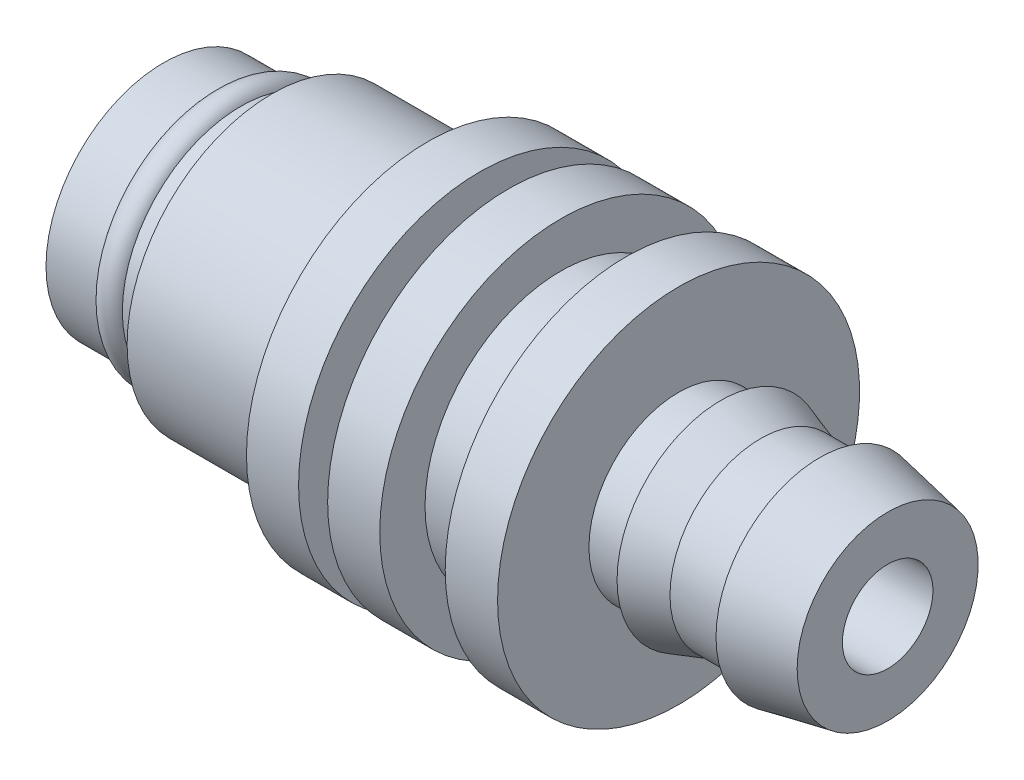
ISO-10303-21;
HEADER;
FILE_DESCRIPTION(('STEP AP214'),'2;1');
FILE_NAME('part.step','',(''),(''),'','','');
FILE_SCHEMA(('AUTOMOTIVE_DESIGN { 1 0 10303 214 1 1 1 1 }'));
ENDSEC;
DATA;
#1=APPLICATION_CONTEXT('core data for automotive mechanical design processes');
#2=APPLICATION_PROTOCOL_DEFINITION('international standard','automotive_design',2000,#1);
#3=PRODUCT_CONTEXT('',#1,'mechanical');
#4=PRODUCT('Part','Part','',(#3));
#5=PRODUCT_RELATED_PRODUCT_CATEGORY('part','',(#4));
#6=PRODUCT_DEFINITION_FORMATION('','',#4);
#7=PRODUCT_DEFINITION_CONTEXT('part definition',#1,'design');
#8=PRODUCT_DEFINITION('design','',#6,#7);
#9=PRODUCT_DEFINITION_SHAPE('','',#8);
#10=(LENGTH_UNIT() NAMED_UNIT(*) SI_UNIT(.MILLI.,.METRE.));
#11=(NAMED_UNIT(*) PLANE_ANGLE_UNIT() SI_UNIT($,.RADIAN.));
#12=(NAMED_UNIT(*) SI_UNIT($,.STERADIAN.) SOLID_ANGLE_UNIT());
#13=UNCERTAINTY_MEASURE_WITH_UNIT(LENGTH_MEASURE(1.E-05),#10,'distance_accuracy_value','');
#14=(GEOMETRIC_REPRESENTATION_CONTEXT(3) GLOBAL_UNCERTAINTY_ASSIGNED_CONTEXT((#13)) GLOBAL_UNIT_ASSIGNED_CONTEXT((#10,
#11,#12)) REPRESENTATION_CONTEXT('',''));
#15=CARTESIAN_POINT('',(0.,0.,0.));
#16=DIRECTION('',(0.,0.,1.));
#17=DIRECTION('',(1.,0.,0.));
#18=AXIS2_PLACEMENT_3D('',#15,#16,#17);
#19=CARTESIAN_POINT('',(11.8147389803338,0.,0.));
#20=DIRECTION('',(-1.,0.,0.));
#21=DIRECTION('',(0.,0.,1.));
#22=AXIS2_PLACEMENT_3D('',#19,#20,#21);
#23=CYLINDRICAL_SURFACE('',#22,2.5);
#24=CARTESIAN_POINT('',(51.8147389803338,0.,0.));
#25=DIRECTION('',(-1.,0.,0.));
#26=DIRECTION('',(0.,0.,1.));
#27=AXIS2_PLACEMENT_3D('',#24,#25,#26);
#28=CIRCLE('',#27,2.5);
#29=CARTESIAN_POINT('',(51.8147389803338,0.,2.5));
#30=VERTEX_POINT('',#29);
#31=EDGE_CURVE('E92',#30,#30,#28,.T.);
#32=ORIENTED_EDGE('',*,*,#31,.F.);
#33=EDGE_LOOP('',(#32));
#34=FACE_BOUND('',#33,.T.);
#35=CARTESIAN_POINT('',(11.8147389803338,0.,0.));
#36=DIRECTION('',(-1.,0.,0.));
#37=DIRECTION('',(0.,0.,1.));
#38=AXIS2_PLACEMENT_3D('',#35,#36,#37);
#39=CIRCLE('',#38,2.5);
#40=CARTESIAN_POINT('',(11.8147389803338,0.,2.5));
#41=VERTEX_POINT('',#40);
#42=EDGE_CURVE('E8',#41,#41,#39,.T.);
#43=ORIENTED_EDGE('',*,*,#42,.T.);
#44=EDGE_LOOP('',(#43));
#45=FACE_BOUND('',#44,.T.);
#46=ADVANCED_FACE('F13',(#34,#45),#23,.F.);
#47=CARTESIAN_POINT('',(11.8147389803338,2.5,0.));
#48=DIRECTION('',(1.,0.,0.));
#49=DIRECTION('',(0.,0.,-1.));
#50=AXIS2_PLACEMENT_3D('',#47,#48,#49);
#51=PLANE('',#50);
#52=ORIENTED_EDGE('',*,*,#42,.F.);
#53=EDGE_LOOP('',(#52));
#54=FACE_BOUND('',#53,.T.);
#55=CARTESIAN_POINT('',(11.8147389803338,0.,0.));
#56=DIRECTION('',(-1.,0.,0.));
#57=DIRECTION('',(0.,0.,1.));
#58=AXIS2_PLACEMENT_3D('',#55,#56,#57);
#59=CIRCLE('',#58,6.5);
#60=CARTESIAN_POINT('',(11.8147389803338,0.,6.5));
#61=VERTEX_POINT('',#60);
#62=EDGE_CURVE('E19',#61,#61,#59,.T.);
#63=ORIENTED_EDGE('',*,*,#62,.T.);
#64=EDGE_LOOP('',(#63));
#65=FACE_BOUND('',#64,.T.);
#66=ADVANCED_FACE('F99',(#54,#65),#51,.F.);
#67=CARTESIAN_POINT('',(11.8147389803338,0.,0.));
#68=DIRECTION('',(-1.,0.,0.));
#69=DIRECTION('',(0.,0.,1.));
#70=AXIS2_PLACEMENT_3D('',#67,#68,#69);
#71=CYLINDRICAL_SURFACE('',#70,6.5);
#72=ORIENTED_EDGE('',*,*,#62,.F.);
#73=EDGE_LOOP('',(#72));
#74=FACE_BOUND('',#73,.T.);
#75=CARTESIAN_POINT('',(14.650729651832,0.,0.));
#76=DIRECTION('',(-1.,0.,0.));
#77=DIRECTION('',(0.,0.,1.));
#78=AXIS2_PLACEMENT_3D('',#75,#76,#77);
#79=CIRCLE('',#78,6.5);
#80=CARTESIAN_POINT('',(14.650729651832,0.,6.5));
#81=VERTEX_POINT('',#80);
#82=EDGE_CURVE('E23',#81,#81,#79,.T.);
#83=ORIENTED_EDGE('',*,*,#82,.T.);
#84=EDGE_LOOP('',(#83));
#85=FACE_BOUND('',#84,.T.);
#86=ADVANCED_FACE('F105',(#74,#85),#71,.T.);
#87=CARTESIAN_POINT('',(15.3792672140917,0.,0.));
#88=DIRECTION('',(-1.,0.,0.));
#89=DIRECTION('',(0.,0.,1.));
#90=AXIS2_PLACEMENT_3D('',#87,#88,#89);
#91=TOROIDAL_SURFACE('',#90,6.17291713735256,0.79859262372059);
#92=ORIENTED_EDGE('',*,*,#82,.F.);
#93=EDGE_LOOP('',(#92));
#94=FACE_BOUND('',#93,.T.);
#95=CARTESIAN_POINT('',(16.0830470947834,0.,0.));
#96=DIRECTION('',(-1.,0.,0.));
#97=DIRECTION('',(0.,0.,1.));
#98=AXIS2_PLACEMENT_3D('',#95,#96,#97);
#99=CIRCLE('',#98,6.550334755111);
#100=CARTESIAN_POINT('',(16.0830470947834,0.,6.550334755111));
#101=VERTEX_POINT('',#100);
#102=EDGE_CURVE('E27',#101,#101,#99,.T.);
#103=ORIENTED_EDGE('',*,*,#102,.T.);
#104=EDGE_LOOP('',(#103));
#105=FACE_BOUND('',#104,.T.);
#106=ADVANCED_FACE('F111',(#94,#105),#91,.T.);
#107=CARTESIAN_POINT('',(11.8147389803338,0.,0.));
#108=DIRECTION('',(-1.,0.,0.));
#109=DIRECTION('',(0.,0.,1.));
#110=AXIS2_PLACEMENT_3D('',#107,#108,#109);
#111=CYLINDRICAL_SURFACE('',#110,6.550334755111);
#112=ORIENTED_EDGE('',*,*,#102,.F.);
#113=EDGE_LOOP('',(#112));
#114=FACE_BOUND('',#113,.T.);
#115=CARTESIAN_POINT('',(17.7956472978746,0.,0.));
#116=DIRECTION('',(-1.,0.,0.));
#117=DIRECTION('',(0.,0.,1.));
#118=AXIS2_PLACEMENT_3D('',#115,#116,#117);
#119=CIRCLE('',#118,6.550334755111);
#120=CARTESIAN_POINT('',(17.7956472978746,0.,6.550334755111));
#121=VERTEX_POINT('',#120);
#122=EDGE_CURVE('E32',#121,#121,#119,.T.);
#123=ORIENTED_EDGE('',*,*,#122,.T.);
#124=EDGE_LOOP('',(#123));
#125=FACE_BOUND('',#124,.T.);
#126=ADVANCED_FACE('F117',(#114,#125),#111,.T.);
#127=CARTESIAN_POINT('',(17.7956472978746,6.550334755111,0.));
#128=DIRECTION('',(1.,0.,0.));
#129=DIRECTION('',(0.,0.,-1.));
#130=AXIS2_PLACEMENT_3D('',#127,#128,#129);
#131=PLANE('',#130);
#132=ORIENTED_EDGE('',*,*,#122,.F.);
#133=EDGE_LOOP('',(#132));
#134=FACE_BOUND('',#133,.T.);
#135=CARTESIAN_POINT('',(17.7956472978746,0.,0.));
#136=DIRECTION('',(-1.,0.,0.));
#137=DIRECTION('',(0.,0.,1.));
#138=AXIS2_PLACEMENT_3D('',#135,#136,#137);
#139=CIRCLE('',#138,8.);
#140=CARTESIAN_POINT('',(17.7956472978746,0.,8.));
#141=VERTEX_POINT('',#140);
#142=EDGE_CURVE('E35',#141,#141,#139,.T.);
#143=ORIENTED_EDGE('',*,*,#142,.T.);
#144=EDGE_LOOP('',(#143));
#145=FACE_BOUND('',#144,.T.);
#146=ADVANCED_FACE('F121',(#134,#145),#131,.F.);
#147=CARTESIAN_POINT('',(11.8147389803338,0.,0.));
#148=DIRECTION('',(-1.,0.,0.));
#149=DIRECTION('',(0.,0.,1.));
#150=AXIS2_PLACEMENT_3D('',#147,#148,#149);
#151=CYLINDRICAL_SURFACE('',#150,8.);
#152=ORIENTED_EDGE('',*,*,#142,.F.);
#153=EDGE_LOOP('',(#152));
#154=FACE_BOUND('',#153,.T.);
#155=CARTESIAN_POINT('',(26.3895519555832,0.,0.));
#156=DIRECTION('',(-1.,0.,0.));
#157=DIRECTION('',(0.,0.,1.));
#158=AXIS2_PLACEMENT_3D('',#155,#156,#157);
#159=CIRCLE('',#158,8.);
#160=CARTESIAN_POINT('',(26.3895519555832,0.,8.));
#161=VERTEX_POINT('',#160);
#162=EDGE_CURVE('E38',#161,#161,#159,.T.);
#163=ORIENTED_EDGE('',*,*,#162,.T.);
#164=EDGE_LOOP('',(#163));
#165=FACE_BOUND('',#164,.T.);
#166=ADVANCED_FACE('F125',(#154,#165),#151,.T.);
#167=CARTESIAN_POINT('',(26.3895519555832,8.,0.));
#168=DIRECTION('',(1.,0.,0.));
#169=DIRECTION('',(0.,0.,-1.));
#170=AXIS2_PLACEMENT_3D('',#167,#168,#169);
#171=PLANE('',#170);
#172=ORIENTED_EDGE('',*,*,#162,.F.);
#173=EDGE_LOOP('',(#172));
#174=FACE_BOUND('',#173,.T.);
#175=CARTESIAN_POINT('',(26.3895519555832,0.,0.));
#176=DIRECTION('',(-1.,0.,0.));
#177=DIRECTION('',(0.,0.,1.));
#178=AXIS2_PLACEMENT_3D('',#175,#176,#177);
#179=CIRCLE('',#178,10.);
#180=CARTESIAN_POINT('',(26.3895519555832,0.,10.));
#181=VERTEX_POINT('',#180);
#182=EDGE_CURVE('E41',#181,#181,#179,.T.);
#183=ORIENTED_EDGE('',*,*,#182,.T.);
#184=EDGE_LOOP('',(#183));
#185=FACE_BOUND('',#184,.T.);
#186=ADVANCED_FACE('F129',(#174,#185),#171,.F.);
#187=CARTESIAN_POINT('',(11.8147389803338,0.,0.));
#188=DIRECTION('',(-1.,0.,0.));
#189=DIRECTION('',(0.,0.,1.));
#190=AXIS2_PLACEMENT_3D('',#187,#188,#189);
#191=CYLINDRICAL_SURFACE('',#190,10.);
#192=ORIENTED_EDGE('',*,*,#182,.F.);
#193=EDGE_LOOP('',(#192));
#194=FACE_BOUND('',#193,.T.);
#195=CARTESIAN_POINT('',(29.2685404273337,0.,0.));
#196=DIRECTION('',(-1.,0.,0.));
#197=DIRECTION('',(0.,0.,1.));
#198=AXIS2_PLACEMENT_3D('',#195,#196,#197);
#199=CIRCLE('',#198,10.);
#200=CARTESIAN_POINT('',(29.2685404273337,0.,10.));
#201=VERTEX_POINT('',#200);
#202=EDGE_CURVE('E44',#201,#201,#199,.T.);
#203=ORIENTED_EDGE('',*,*,#202,.T.);
#204=EDGE_LOOP('',(#203));
#205=FACE_BOUND('',#204,.T.);
#206=ADVANCED_FACE('F133',(#194,#205),#191,.T.);
#207=CARTESIAN_POINT('',(29.2685404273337,10.,0.));
#208=DIRECTION('',(-1.,0.,0.));
#209=DIRECTION('',(0.,0.,1.));
#210=AXIS2_PLACEMENT_3D('',#207,#208,#209);
#211=PLANE('',#210);
#212=ORIENTED_EDGE('',*,*,#202,.F.);
#213=EDGE_LOOP('',(#212));
#214=FACE_BOUND('',#213,.T.);
#215=CARTESIAN_POINT('',(29.2685404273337,0.,0.));
#216=DIRECTION('',(-1.,0.,0.));
#217=DIRECTION('',(0.,0.,1.));
#218=AXIS2_PLACEMENT_3D('',#215,#216,#217);
#219=CIRCLE('',#218,7.5);
#220=CARTESIAN_POINT('',(29.2685404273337,0.,7.5));
#221=VERTEX_POINT('',#220);
#222=EDGE_CURVE('E47',#221,#221,#219,.T.);
#223=ORIENTED_EDGE('',*,*,#222,.T.);
#224=EDGE_LOOP('',(#223));
#225=FACE_BOUND('',#224,.T.);
#226=ADVANCED_FACE('F137',(#214,#225),#211,.F.);
#227=CARTESIAN_POINT('',(11.8147389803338,0.,0.));
#228=DIRECTION('',(-1.,0.,0.));
#229=DIRECTION('',(0.,0.,1.));
#230=AXIS2_PLACEMENT_3D('',#227,#228,#229);
#231=CYLINDRICAL_SURFACE('',#230,7.5);
#232=ORIENTED_EDGE('',*,*,#222,.F.);
#233=EDGE_LOOP('',(#232));
#234=FACE_BOUND('',#233,.T.);
#235=CARTESIAN_POINT('',(30.8744314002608,0.,0.));
#236=DIRECTION('',(-1.,0.,0.));
#237=DIRECTION('',(0.,0.,1.));
#238=AXIS2_PLACEMENT_3D('',#235,#236,#237);
#239=CIRCLE('',#238,7.5);
#240=CARTESIAN_POINT('',(30.8744314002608,0.,7.5));
#241=VERTEX_POINT('',#240);
#242=EDGE_CURVE('E50',#241,#241,#239,.T.);
#243=ORIENTED_EDGE('',*,*,#242,.T.);
#244=EDGE_LOOP('',(#243));
#245=FACE_BOUND('',#244,.T.);
#246=ADVANCED_FACE('F141',(#234,#245),#231,.T.);
#247=CARTESIAN_POINT('',(30.8744314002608,10.,0.));
#248=DIRECTION('',(1.,0.,0.));
#249=DIRECTION('',(0.,0.,-1.));
#250=AXIS2_PLACEMENT_3D('',#247,#248,#249);
#251=PLANE('',#250);
#252=ORIENTED_EDGE('',*,*,#242,.F.);
#253=EDGE_LOOP('',(#252));
#254=FACE_BOUND('',#253,.T.);
#255=CARTESIAN_POINT('',(30.8744314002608,0.,0.));
#256=DIRECTION('',(-1.,0.,0.));
#257=DIRECTION('',(0.,0.,1.));
#258=AXIS2_PLACEMENT_3D('',#255,#256,#257);
#259=CIRCLE('',#258,10.);
#260=CARTESIAN_POINT('',(30.8744314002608,0.,10.));
#261=VERTEX_POINT('',#260);
#262=EDGE_CURVE('E53',#261,#261,#259,.T.);
#263=ORIENTED_EDGE('',*,*,#262,.T.);
#264=EDGE_LOOP('',(#263));
#265=FACE_BOUND('',#264,.T.);
#266=ADVANCED_FACE('F145',(#254,#265),#251,.F.);
#267=CARTESIAN_POINT('',(11.8147389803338,0.,0.));
#268=DIRECTION('',(-1.,0.,0.));
#269=DIRECTION('',(0.,0.,1.));
#270=AXIS2_PLACEMENT_3D('',#267,#268,#269);
#271=CYLINDRICAL_SURFACE('',#270,10.);
#272=ORIENTED_EDGE('',*,*,#262,.F.);
#273=EDGE_LOOP('',(#272));
#274=FACE_BOUND('',#273,.T.);
#275=CARTESIAN_POINT('',(33.7534198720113,0.,0.));
#276=DIRECTION('',(-1.,0.,0.));
#277=DIRECTION('',(0.,0.,1.));
#278=AXIS2_PLACEMENT_3D('',#275,#276,#277);
#279=CIRCLE('',#278,10.);
#280=CARTESIAN_POINT('',(33.7534198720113,0.,10.));
#281=VERTEX_POINT('',#280);
#282=EDGE_CURVE('E56',#281,#281,#279,.T.);
#283=ORIENTED_EDGE('',*,*,#282,.T.);
#284=EDGE_LOOP('',(#283));
#285=FACE_BOUND('',#284,.T.);
#286=ADVANCED_FACE('F149',(#274,#285),#271,.T.);
#287=CARTESIAN_POINT('',(33.7534198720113,8.,0.));
#288=DIRECTION('',(-1.,0.,0.));
#289=DIRECTION('',(0.,0.,1.));
#290=AXIS2_PLACEMENT_3D('',#287,#288,#289);
#291=PLANE('',#290);
#292=ORIENTED_EDGE('',*,*,#282,.F.);
#293=EDGE_LOOP('',(#292));
#294=FACE_BOUND('',#293,.T.);
#295=CARTESIAN_POINT('',(33.7534198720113,0.,0.));
#296=DIRECTION('',(-1.,0.,0.));
#297=DIRECTION('',(0.,0.,1.));
#298=AXIS2_PLACEMENT_3D('',#295,#296,#297);
#299=CIRCLE('',#298,7.5);
#300=CARTESIAN_POINT('',(33.7534198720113,0.,7.5));
#301=VERTEX_POINT('',#300);
#302=EDGE_CURVE('E59',#301,#301,#299,.T.);
#303=ORIENTED_EDGE('',*,*,#302,.T.);
#304=EDGE_LOOP('',(#303));
#305=FACE_BOUND('',#304,.T.);
#306=ADVANCED_FACE('F153',(#294,#305),#291,.F.);
#307=CARTESIAN_POINT('',(11.8147389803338,0.,0.));
#308=DIRECTION('',(-1.,0.,0.));
#309=DIRECTION('',(0.,0.,1.));
#310=AXIS2_PLACEMENT_3D('',#307,#308,#309);
#311=CYLINDRICAL_SURFACE('',#310,7.5);
#312=ORIENTED_EDGE('',*,*,#302,.F.);
#313=EDGE_LOOP('',(#312));
#314=FACE_BOUND('',#313,.T.);
#315=CARTESIAN_POINT('',(37.3700632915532,0.,0.));
#316=DIRECTION('',(-1.,0.,0.));
#317=DIRECTION('',(0.,0.,1.));
#318=AXIS2_PLACEMENT_3D('',#315,#316,#317);
#319=CIRCLE('',#318,7.5);
#320=CARTESIAN_POINT('',(37.3700632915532,0.,7.5));
#321=VERTEX_POINT('',#320);
#322=EDGE_CURVE('E62',#321,#321,#319,.T.);
#323=ORIENTED_EDGE('',*,*,#322,.T.);
#324=EDGE_LOOP('',(#323));
#325=FACE_BOUND('',#324,.T.);
#326=ADVANCED_FACE('F157',(#314,#325),#311,.T.);
#327=CARTESIAN_POINT('',(37.3700632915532,7.5,0.));
#328=DIRECTION('',(1.,0.,0.));
#329=DIRECTION('',(0.,0.,-1.));
#330=AXIS2_PLACEMENT_3D('',#327,#328,#329);
#331=PLANE('',#330);
#332=ORIENTED_EDGE('',*,*,#322,.F.);
#333=EDGE_LOOP('',(#332));
#334=FACE_BOUND('',#333,.T.);
#335=CARTESIAN_POINT('',(37.3700632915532,0.,0.));
#336=DIRECTION('',(-1.,0.,0.));
#337=DIRECTION('',(0.,0.,1.));
#338=AXIS2_PLACEMENT_3D('',#335,#336,#337);
#339=CIRCLE('',#338,10.);
#340=CARTESIAN_POINT('',(37.3700632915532,0.,10.));
#341=VERTEX_POINT('',#340);
#342=EDGE_CURVE('E65',#341,#341,#339,.T.);
#343=ORIENTED_EDGE('',*,*,#342,.T.);
#344=EDGE_LOOP('',(#343));
#345=FACE_BOUND('',#344,.T.);
#346=ADVANCED_FACE('F161',(#334,#345),#331,.F.);
#347=CARTESIAN_POINT('',(11.8147389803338,0.,0.));
#348=DIRECTION('',(-1.,0.,0.));
#349=DIRECTION('',(0.,0.,1.));
#350=AXIS2_PLACEMENT_3D('',#347,#348,#349);
#351=CYLINDRICAL_SURFACE('',#350,10.);
#352=ORIENTED_EDGE('',*,*,#342,.F.);
#353=EDGE_LOOP('',(#352));
#354=FACE_BOUND('',#353,.T.);
#355=CARTESIAN_POINT('',(40.2624891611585,0.,0.));
#356=DIRECTION('',(-1.,0.,0.));
#357=DIRECTION('',(0.,0.,1.));
#358=AXIS2_PLACEMENT_3D('',#355,#356,#357);
#359=CIRCLE('',#358,10.);
#360=CARTESIAN_POINT('',(40.2624891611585,0.,10.));
#361=VERTEX_POINT('',#360);
#362=EDGE_CURVE('E68',#361,#361,#359,.T.);
#363=ORIENTED_EDGE('',*,*,#362,.T.);
#364=EDGE_LOOP('',(#363));
#365=FACE_BOUND('',#364,.T.);
#366=ADVANCED_FACE('F165',(#354,#365),#351,.T.);
#367=CARTESIAN_POINT('',(40.2624891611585,10.,0.));
#368=DIRECTION('',(-1.,0.,0.));
#369=DIRECTION('',(0.,0.,1.));
#370=AXIS2_PLACEMENT_3D('',#367,#368,#369);
#371=PLANE('',#370);
#372=ORIENTED_EDGE('',*,*,#362,.F.);
#373=EDGE_LOOP('',(#372));
#374=FACE_BOUND('',#373,.T.);
#375=CARTESIAN_POINT('',(40.2624891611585,0.,0.));
#376=DIRECTION('',(-1.,0.,0.));
#377=DIRECTION('',(0.,0.,1.));
#378=AXIS2_PLACEMENT_3D('',#375,#376,#377);
#379=CIRCLE('',#378,4.95292793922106);
#380=CARTESIAN_POINT('',(40.2624891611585,0.,4.95292793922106));
#381=VERTEX_POINT('',#380);
#382=EDGE_CURVE('E71',#381,#381,#379,.T.);
#383=ORIENTED_EDGE('',*,*,#382,.T.);
#384=EDGE_LOOP('',(#383));
#385=FACE_BOUND('',#384,.T.);
#386=ADVANCED_FACE('F169',(#374,#385),#371,.F.);
#387=CARTESIAN_POINT('',(11.8147389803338,0.,0.));
#388=DIRECTION('',(-1.,0.,0.));
#389=DIRECTION('',(0.,0.,1.));
#390=AXIS2_PLACEMENT_3D('',#387,#388,#389);
#391=CYLINDRICAL_SURFACE('',#390,4.95292793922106);
#392=ORIENTED_EDGE('',*,*,#382,.F.);
#393=EDGE_LOOP('',(#392));
#394=FACE_BOUND('',#393,.T.);
#395=CARTESIAN_POINT('',(42.5894895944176,0.,0.));
#396=DIRECTION('',(-1.,0.,0.));
#397=DIRECTION('',(0.,0.,1.));
#398=AXIS2_PLACEMENT_3D('',#395,#396,#397);
#399=CIRCLE('',#398,4.95292793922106);
#400=CARTESIAN_POINT('',(42.5894895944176,0.,4.95292793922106));
#401=VERTEX_POINT('',#400);
#402=EDGE_CURVE('E74',#401,#401,#399,.T.);
#403=ORIENTED_EDGE('',*,*,#402,.T.);
#404=EDGE_LOOP('',(#403));
#405=FACE_BOUND('',#404,.T.);
#406=ADVANCED_FACE('F173',(#394,#405),#391,.T.);
#407=CARTESIAN_POINT('',(42.5894895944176,5.72606231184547,0.));
#408=DIRECTION('',(1.,0.,0.));
#409=DIRECTION('',(0.,0.,-1.));
#410=AXIS2_PLACEMENT_3D('',#407,#408,#409);
#411=PLANE('',#410);
#412=ORIENTED_EDGE('',*,*,#402,.F.);
#413=EDGE_LOOP('',(#412));
#414=FACE_BOUND('',#413,.T.);
#415=CARTESIAN_POINT('',(42.5894895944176,0.,0.));
#416=DIRECTION('',(-1.,0.,0.));
#417=DIRECTION('',(0.,0.,1.));
#418=AXIS2_PLACEMENT_3D('',#415,#416,#417);
#419=CIRCLE('',#418,5.72606231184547);
#420=CARTESIAN_POINT('',(42.5894895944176,0.,5.72606231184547));
#421=VERTEX_POINT('',#420);
#422=EDGE_CURVE('E77',#421,#421,#419,.T.);
#423=ORIENTED_EDGE('',*,*,#422,.T.);
#424=EDGE_LOOP('',(#423));
#425=FACE_BOUND('',#424,.T.);
#426=ADVANCED_FACE('F177',(#414,#425),#411,.F.);
#427=CARTESIAN_POINT('',(44.7876778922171,0.,0.));
#428=DIRECTION('',(-1.,0.,0.));
#429=DIRECTION('',(0.,0.,1.));
#430=AXIS2_PLACEMENT_3D('',#427,#428,#429);
#431=CONICAL_SURFACE('',#430,5.,0.319018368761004);
#432=ORIENTED_EDGE('',*,*,#422,.F.);
#433=EDGE_LOOP('',(#432));
#434=FACE_BOUND('',#433,.T.);
#435=CARTESIAN_POINT('',(44.7876778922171,0.,0.));
#436=DIRECTION('',(-1.,0.,0.));
#437=DIRECTION('',(0.,0.,1.));
#438=AXIS2_PLACEMENT_3D('',#435,#436,#437);
#439=CIRCLE('',#438,5.);
#440=CARTESIAN_POINT('',(44.7876778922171,0.,5.));
#441=VERTEX_POINT('',#440);
#442=EDGE_CURVE('E80',#441,#441,#439,.T.);
#443=ORIENTED_EDGE('',*,*,#442,.T.);
#444=EDGE_LOOP('',(#443));
#445=FACE_BOUND('',#444,.T.);
#446=ADVANCED_FACE('F181',(#434,#445),#431,.T.);
#447=CARTESIAN_POINT('',(11.8147389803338,0.,0.));
#448=DIRECTION('',(-1.,0.,0.));
#449=DIRECTION('',(0.,0.,1.));
#450=AXIS2_PLACEMENT_3D('',#447,#448,#449);
#451=CYLINDRICAL_SURFACE('',#450,5.);
#452=ORIENTED_EDGE('',*,*,#442,.F.);
#453=EDGE_LOOP('',(#452));
#454=FACE_BOUND('',#453,.T.);
#455=CARTESIAN_POINT('',(48.0568845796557,0.,0.));
#456=DIRECTION('',(-1.,0.,0.));
#457=DIRECTION('',(0.,0.,1.));
#458=AXIS2_PLACEMENT_3D('',#455,#456,#457);
#459=CIRCLE('',#458,5.);
#460=CARTESIAN_POINT('',(48.0568845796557,0.,5.));
#461=VERTEX_POINT('',#460);
#462=EDGE_CURVE('E83',#461,#461,#459,.T.);
#463=ORIENTED_EDGE('',*,*,#462,.T.);
#464=EDGE_LOOP('',(#463));
#465=FACE_BOUND('',#464,.T.);
#466=ADVANCED_FACE('F185',(#454,#465),#451,.T.);
#467=CARTESIAN_POINT('',(48.0568845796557,5.,0.));
#468=DIRECTION('',(1.,0.,0.));
#469=DIRECTION('',(0.,0.,-1.));
#470=AXIS2_PLACEMENT_3D('',#467,#468,#469);
#471=PLANE('',#470);
#472=ORIENTED_EDGE('',*,*,#462,.F.);
#473=EDGE_LOOP('',(#472));
#474=FACE_BOUND('',#473,.T.);
#475=CARTESIAN_POINT('',(48.0568845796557,0.,0.));
#476=DIRECTION('',(-1.,0.,0.));
#477=DIRECTION('',(0.,0.,1.));
#478=AXIS2_PLACEMENT_3D('',#475,#476,#477);
#479=CIRCLE('',#478,5.72606231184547);
#480=CARTESIAN_POINT('',(48.0568845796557,0.,5.72606231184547));
#481=VERTEX_POINT('',#480);
#482=EDGE_CURVE('E86',#481,#481,#479,.T.);
#483=ORIENTED_EDGE('',*,*,#482,.T.);
#484=EDGE_LOOP('',(#483));
#485=FACE_BOUND('',#484,.T.);
#486=ADVANCED_FACE('F189',(#474,#485),#471,.F.);
#487=CARTESIAN_POINT('',(51.8147389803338,0.,0.));
#488=DIRECTION('',(-1.,0.,0.));
#489=DIRECTION('',(0.,0.,1.));
#490=AXIS2_PLACEMENT_3D('',#487,#488,#489);
#491=CONICAL_SURFACE('',#490,5.,0.190860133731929);
#492=ORIENTED_EDGE('',*,*,#482,.F.);
#493=EDGE_LOOP('',(#492));
#494=FACE_BOUND('',#493,.T.);
#495=CARTESIAN_POINT('',(51.8147389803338,0.,0.));
#496=DIRECTION('',(-1.,0.,0.));
#497=DIRECTION('',(0.,0.,1.));
#498=AXIS2_PLACEMENT_3D('',#495,#496,#497);
#499=CIRCLE('',#498,5.);
#500=CARTESIAN_POINT('',(51.8147389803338,0.,5.));
#501=VERTEX_POINT('',#500);
#502=EDGE_CURVE('E89',#501,#501,#499,.T.);
#503=ORIENTED_EDGE('',*,*,#502,.T.);
#504=EDGE_LOOP('',(#503));
#505=FACE_BOUND('',#504,.T.);
#506=ADVANCED_FACE('F193',(#494,#505),#491,.T.);
#507=CARTESIAN_POINT('',(51.8147389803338,5.,0.));
#508=DIRECTION('',(-1.,0.,0.));
#509=DIRECTION('',(0.,0.,1.));
#510=AXIS2_PLACEMENT_3D('',#507,#508,#509);
#511=PLANE('',#510);
#512=ORIENTED_EDGE('',*,*,#502,.F.);
#513=EDGE_LOOP('',(#512));
#514=FACE_BOUND('',#513,.T.);
#515=ORIENTED_EDGE('',*,*,#31,.T.);
#516=EDGE_LOOP('',(#515));
#517=FACE_BOUND('',#516,.T.);
#518=ADVANCED_FACE('F96',(#514,#517),#511,.F.);
#519=CLOSED_SHELL('',(#46,#66,#86,#106,#126,#146,#166,#186,#206,#226,#246,#266,#286,#306,#326,
#346,#366,#386,#406,#426,#446,#466,#486,#506,#518));
#520=MANIFOLD_SOLID_BREP('B1',#519);
#521=ADVANCED_BREP_SHAPE_REPRESENTATION('',(#18,#520),#14);
#522=SHAPE_DEFINITION_REPRESENTATION(#9,#521);
ENDSEC;
END-ISO-10303-21;
